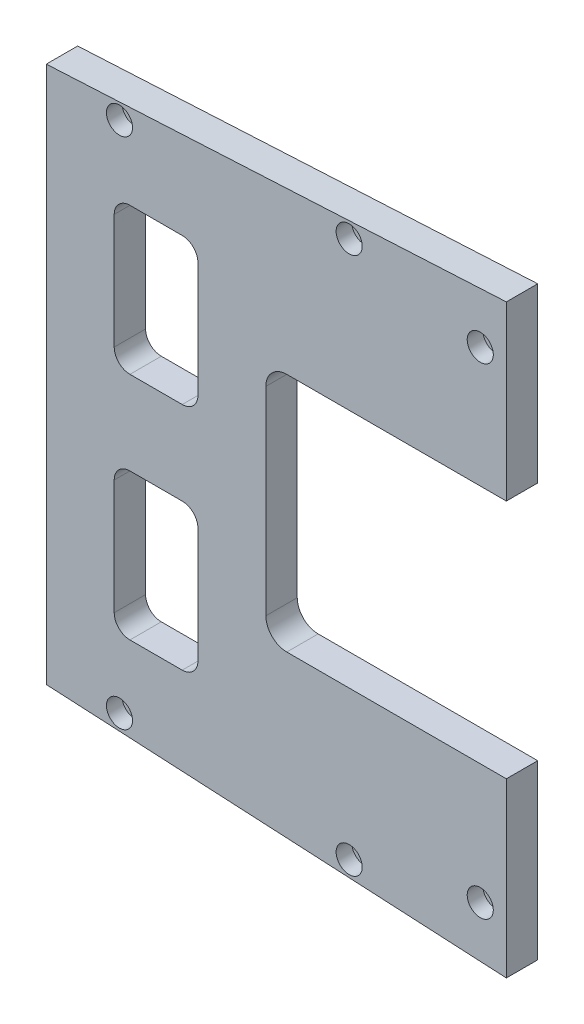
ISO-10303-21;
HEADER;
FILE_DESCRIPTION(('STEP AP214'),'2;1');
FILE_NAME('part.step','',(''),(''),'','','');
FILE_SCHEMA(('AUTOMOTIVE_DESIGN { 1 0 10303 214 1 1 1 1 }'));
ENDSEC;
DATA;
#1=APPLICATION_CONTEXT('core data for automotive mechanical design processes');
#2=APPLICATION_PROTOCOL_DEFINITION('international standard','automotive_design',2000,#1);
#3=PRODUCT_CONTEXT('',#1,'mechanical');
#4=PRODUCT('Part','Part','',(#3));
#5=PRODUCT_RELATED_PRODUCT_CATEGORY('part','',(#4));
#6=PRODUCT_DEFINITION_FORMATION('','',#4);
#7=PRODUCT_DEFINITION_CONTEXT('part definition',#1,'design');
#8=PRODUCT_DEFINITION('design','',#6,#7);
#9=PRODUCT_DEFINITION_SHAPE('','',#8);
#10=(LENGTH_UNIT() NAMED_UNIT(*) SI_UNIT(.MILLI.,.METRE.));
#11=(NAMED_UNIT(*) PLANE_ANGLE_UNIT() SI_UNIT($,.RADIAN.));
#12=(NAMED_UNIT(*) SI_UNIT($,.STERADIAN.) SOLID_ANGLE_UNIT());
#13=UNCERTAINTY_MEASURE_WITH_UNIT(LENGTH_MEASURE(1.E-05),#10,'distance_accuracy_value','');
#14=(GEOMETRIC_REPRESENTATION_CONTEXT(3) GLOBAL_UNCERTAINTY_ASSIGNED_CONTEXT((#13)) GLOBAL_UNIT_ASSIGNED_CONTEXT((#10,
#11,#12)) REPRESENTATION_CONTEXT('',''));
#15=CARTESIAN_POINT('',(0.,0.,0.));
#16=DIRECTION('',(0.,0.,1.));
#17=DIRECTION('',(1.,0.,0.));
#18=AXIS2_PLACEMENT_3D('',#15,#16,#17);
#19=CARTESIAN_POINT('',(0.,0.,9.525));
#20=DIRECTION('',(0.,0.,-1.));
#21=DIRECTION('',(-1.,0.,0.));
#22=AXIS2_PLACEMENT_3D('',#19,#20,#21);
#23=PLANE('',#22);
#24=DIRECTION('',(0.,1.,0.));
#25=VECTOR('',#24,1.);
#26=CARTESIAN_POINT('',(46.0502,0.,9.525));
#27=LINE('',#26,#25);
#28=CARTESIAN_POINT('',(46.0502,-52.3748,9.525));
#29=VERTEX_POINT('',#28);
#30=CARTESIAN_POINT('',(46.0502,-17.4752,9.525));
#31=VERTEX_POINT('',#30);
#32=EDGE_CURVE('E420',#29,#31,#27,.T.);
#33=ORIENTED_EDGE('',*,*,#32,.F.);
#34=CARTESIAN_POINT('',(41.275,-52.3748,9.525));
#35=DIRECTION('',(0.,0.,-1.));
#36=DIRECTION('',(-1.,0.,0.));
#37=AXIS2_PLACEMENT_3D('',#34,#35,#36);
#38=CIRCLE('',#37,4.7752);
#39=CARTESIAN_POINT('',(41.275,-57.15,9.525));
#40=VERTEX_POINT('',#39);
#41=EDGE_CURVE('E345',#29,#40,#38,.T.);
#42=ORIENTED_EDGE('',*,*,#41,.T.);
#43=DIRECTION('',(1.,0.,0.));
#44=VECTOR('',#43,1.);
#45=CARTESIAN_POINT('',(0.,-57.15,9.525));
#46=LINE('',#45,#44);
#47=CARTESIAN_POINT('',(25.4,-57.15,9.525));
#48=VERTEX_POINT('',#47);
#49=EDGE_CURVE('E411',#48,#40,#46,.T.);
#50=ORIENTED_EDGE('',*,*,#49,.F.);
#51=CARTESIAN_POINT('',(25.4,-52.3748,9.525));
#52=DIRECTION('',(0.,0.,-1.));
#53=DIRECTION('',(-1.,0.,0.));
#54=AXIS2_PLACEMENT_3D('',#51,#52,#53);
#55=CIRCLE('',#54,4.7752);
#56=CARTESIAN_POINT('',(20.6248,-52.3748,9.525));
#57=VERTEX_POINT('',#56);
#58=EDGE_CURVE('E341',#48,#57,#55,.T.);
#59=ORIENTED_EDGE('',*,*,#58,.T.);
#60=DIRECTION('',(0.,-1.,0.));
#61=VECTOR('',#60,1.);
#62=CARTESIAN_POINT('',(20.6248,0.,9.525));
#63=LINE('',#62,#61);
#64=CARTESIAN_POINT('',(20.6248,-17.4752,9.525));
#65=VERTEX_POINT('',#64);
#66=EDGE_CURVE('E414',#65,#57,#63,.T.);
#67=ORIENTED_EDGE('',*,*,#66,.F.);
#68=CARTESIAN_POINT('',(25.4,-17.4752,9.525));
#69=DIRECTION('',(0.,0.,-1.));
#70=DIRECTION('',(-1.,0.,0.));
#71=AXIS2_PLACEMENT_3D('',#68,#69,#70);
#72=CIRCLE('',#71,4.7752);
#73=CARTESIAN_POINT('',(25.4,-12.7,9.525));
#74=VERTEX_POINT('',#73);
#75=EDGE_CURVE('E353',#65,#74,#72,.T.);
#76=ORIENTED_EDGE('',*,*,#75,.T.);
#77=DIRECTION('',(-1.,0.,0.));
#78=VECTOR('',#77,1.);
#79=CARTESIAN_POINT('',(0.,-12.7,9.525));
#80=LINE('',#79,#78);
#81=CARTESIAN_POINT('',(41.275,-12.7,9.525));
#82=VERTEX_POINT('',#81);
#83=EDGE_CURVE('E417',#82,#74,#80,.T.);
#84=ORIENTED_EDGE('',*,*,#83,.F.);
#85=CARTESIAN_POINT('',(41.275,-17.4752,9.525));
#86=DIRECTION('',(0.,0.,-1.));
#87=DIRECTION('',(-1.,0.,0.));
#88=AXIS2_PLACEMENT_3D('',#85,#86,#87);
#89=CIRCLE('',#88,4.7752);
#90=EDGE_CURVE('E349',#82,#31,#89,.T.);
#91=ORIENTED_EDGE('',*,*,#90,.T.);
#92=EDGE_LOOP('',(#33,#42,#50,#59,#67,#76,#84,#91));
#93=FACE_BOUND('',#92,.T.);
#94=CARTESIAN_POINT('',(91.979273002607,-81.6173094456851,9.525));
#95=DIRECTION('',(0.,0.,-1.));
#96=DIRECTION('',(-1.,0.,0.));
#97=AXIS2_PLACEMENT_3D('',#94,#95,#96);
#98=CIRCLE('',#97,3.9624);
#99=CARTESIAN_POINT('',(88.016873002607,-81.6173094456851,9.525));
#100=VERTEX_POINT('',#99);
#101=EDGE_CURVE('E290',#100,#100,#98,.F.);
#102=ORIENTED_EDGE('',*,*,#101,.F.);
#103=EDGE_LOOP('',(#102));
#104=FACE_BOUND('',#103,.T.);
#105=CARTESIAN_POINT('',(22.225,77.9616429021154,9.525));
#106=DIRECTION('',(0.,0.,-1.));
#107=DIRECTION('',(-1.,0.,0.));
#108=AXIS2_PLACEMENT_3D('',#105,#106,#107);
#109=CIRCLE('',#108,3.9624);
#110=CARTESIAN_POINT('',(18.2626,77.9616429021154,9.525));
#111=VERTEX_POINT('',#110);
#112=EDGE_CURVE('E275',#111,#111,#109,.F.);
#113=ORIENTED_EDGE('',*,*,#112,.F.);
#114=EDGE_LOOP('',(#113));
#115=FACE_BOUND('',#114,.T.);
#116=CARTESIAN_POINT('',(131.7752,-73.025,9.525));
#117=DIRECTION('',(0.,0.,-1.));
#118=DIRECTION('',(-1.,0.,0.));
#119=AXIS2_PLACEMENT_3D('',#116,#117,#118);
#120=CIRCLE('',#119,3.9624);
#121=CARTESIAN_POINT('',(127.8128,-73.025,9.525));
#122=VERTEX_POINT('',#121);
#123=EDGE_CURVE('E260',#122,#122,#120,.F.);
#124=ORIENTED_EDGE('',*,*,#123,.F.);
#125=EDGE_LOOP('',(#124));
#126=FACE_BOUND('',#125,.T.);
#127=DIRECTION('',(0.,1.,0.));
#128=VECTOR('',#127,1.);
#129=CARTESIAN_POINT('',(139.7,-36.5125,9.525));
#130=LINE('',#129,#128);
#131=CARTESIAN_POINT('',(139.7,-88.9,9.525));
#132=VERTEX_POINT('',#131);
#133=CARTESIAN_POINT('',(139.7,-36.5125,9.525));
#134=VERTEX_POINT('',#133);
#135=EDGE_CURVE('E218',#132,#134,#130,.T.);
#136=ORIENTED_EDGE('',*,*,#135,.T.);
#137=DIRECTION('',(-1.,0.,0.));
#138=VECTOR('',#137,1.);
#139=CARTESIAN_POINT('',(66.675,-36.5125,9.525));
#140=LINE('',#139,#138);
#141=CARTESIAN_POINT('',(73.025,-36.5125,9.525));
#142=VERTEX_POINT('',#141);
#143=EDGE_CURVE('E206',#134,#142,#140,.T.);
#144=ORIENTED_EDGE('',*,*,#143,.T.);
#145=CARTESIAN_POINT('',(73.025,-30.1625,9.525));
#146=DIRECTION('',(0.,0.,-1.));
#147=DIRECTION('',(-1.,0.,0.));
#148=AXIS2_PLACEMENT_3D('',#145,#146,#147);
#149=CIRCLE('',#148,6.35);
#150=CARTESIAN_POINT('',(66.675,-30.1625,9.525));
#151=VERTEX_POINT('',#150);
#152=EDGE_CURVE('E250',#142,#151,#149,.T.);
#153=ORIENTED_EDGE('',*,*,#152,.T.);
#154=DIRECTION('',(0.,1.,0.));
#155=VECTOR('',#154,1.);
#156=CARTESIAN_POINT('',(66.675,36.5125,9.525));
#157=LINE('',#156,#155);
#158=CARTESIAN_POINT('',(66.675,30.1625,9.525));
#159=VERTEX_POINT('',#158);
#160=EDGE_CURVE('E217',#151,#159,#157,.T.);
#161=ORIENTED_EDGE('',*,*,#160,.T.);
#162=CARTESIAN_POINT('',(73.025,30.1625,9.525));
#163=DIRECTION('',(0.,0.,-1.));
#164=DIRECTION('',(-1.,0.,0.));
#165=AXIS2_PLACEMENT_3D('',#162,#163,#164);
#166=CIRCLE('',#165,6.35);
#167=CARTESIAN_POINT('',(73.025,36.5125,9.525));
#168=VERTEX_POINT('',#167);
#169=EDGE_CURVE('E254',#159,#168,#166,.T.);
#170=ORIENTED_EDGE('',*,*,#169,.T.);
#171=DIRECTION('',(1.,0.,0.));
#172=VECTOR('',#171,1.);
#173=CARTESIAN_POINT('',(139.7,36.5125,9.525));
#174=LINE('',#173,#172);
#175=CARTESIAN_POINT('',(139.7,36.5125,9.525));
#176=VERTEX_POINT('',#175);
#177=EDGE_CURVE('E453',#168,#176,#174,.T.);
#178=ORIENTED_EDGE('',*,*,#177,.T.);
#179=DIRECTION('',(0.,1.,0.));
#180=VECTOR('',#179,1.);
#181=CARTESIAN_POINT('',(139.7,88.9,9.525));
#182=LINE('',#181,#180);
#183=CARTESIAN_POINT('',(139.7,88.9,9.525));
#184=VERTEX_POINT('',#183);
#185=EDGE_CURVE('E455',#176,#184,#182,.T.);
#186=ORIENTED_EDGE('',*,*,#185,.T.);
#187=DIRECTION('',(-0.998629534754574,-0.0523359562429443,0.));
#188=VECTOR('',#187,1.);
#189=CARTESIAN_POINT('',(0.,81.5786332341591,9.525));
#190=LINE('',#189,#188);
#191=CARTESIAN_POINT('',(0.,81.5786332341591,9.525));
#192=VERTEX_POINT('',#191);
#193=EDGE_CURVE('E457',#184,#192,#190,.T.);
#194=ORIENTED_EDGE('',*,*,#193,.T.);
#195=DIRECTION('',(0.,-1.,0.));
#196=VECTOR('',#195,1.);
#197=CARTESIAN_POINT('',(0.,0.,9.525));
#198=LINE('',#197,#196);
#199=CARTESIAN_POINT('',(0.,-81.5786332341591,9.525));
#200=VERTEX_POINT('',#199);
#201=EDGE_CURVE('E459',#192,#200,#198,.T.);
#202=ORIENTED_EDGE('',*,*,#201,.T.);
#203=DIRECTION('',(0.998629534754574,-0.0523359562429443,0.));
#204=VECTOR('',#203,1.);
#205=CARTESIAN_POINT('',(139.7,-88.9,9.525));
#206=LINE('',#205,#204);
#207=EDGE_CURVE('E223',#200,#132,#206,.T.);
#208=ORIENTED_EDGE('',*,*,#207,.T.);
#209=EDGE_LOOP('',(#136,#144,#153,#161,#170,#178,#186,#194,#202,#208));
#210=FACE_BOUND('',#209,.T.);
#211=CARTESIAN_POINT('',(131.7752,73.025,9.525));
#212=DIRECTION('',(0.,0.,-1.));
#213=DIRECTION('',(-1.,0.,0.));
#214=AXIS2_PLACEMENT_3D('',#211,#212,#213);
#215=CIRCLE('',#214,3.9624);
#216=CARTESIAN_POINT('',(127.8128,73.025,9.525));
#217=VERTEX_POINT('',#216);
#218=EDGE_CURVE('E268',#217,#217,#215,.F.);
#219=ORIENTED_EDGE('',*,*,#218,.F.);
#220=EDGE_LOOP('',(#219));
#221=FACE_BOUND('',#220,.T.);
#222=CARTESIAN_POINT('',(91.979273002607,81.6173094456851,9.525));
#223=DIRECTION('',(0.,0.,-1.));
#224=DIRECTION('',(-1.,0.,0.));
#225=AXIS2_PLACEMENT_3D('',#222,#223,#224);
#226=CIRCLE('',#225,3.9624);
#227=CARTESIAN_POINT('',(88.016873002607,81.6173094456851,9.525));
#228=VERTEX_POINT('',#227);
#229=EDGE_CURVE('E283',#228,#228,#226,.F.);
#230=ORIENTED_EDGE('',*,*,#229,.F.);
#231=EDGE_LOOP('',(#230));
#232=FACE_BOUND('',#231,.T.);
#233=CARTESIAN_POINT('',(22.225,-77.9616429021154,9.525));
#234=DIRECTION('',(0.,0.,-1.));
#235=DIRECTION('',(-1.,0.,0.));
#236=AXIS2_PLACEMENT_3D('',#233,#234,#235);
#237=CIRCLE('',#236,3.96239999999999);
#238=CARTESIAN_POINT('',(18.2626,-77.9616429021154,9.525));
#239=VERTEX_POINT('',#238);
#240=EDGE_CURVE('E297',#239,#239,#237,.F.);
#241=ORIENTED_EDGE('',*,*,#240,.F.);
#242=EDGE_LOOP('',(#241));
#243=FACE_BOUND('',#242,.T.);
#244=DIRECTION('',(0.,-1.,0.));
#245=VECTOR('',#244,1.);
#246=CARTESIAN_POINT('',(20.6248,0.,9.525));
#247=LINE('',#246,#245);
#248=CARTESIAN_POINT('',(20.6248,52.3748,9.525));
#249=VERTEX_POINT('',#248);
#250=CARTESIAN_POINT('',(20.6248,17.4752,9.525));
#251=VERTEX_POINT('',#250);
#252=EDGE_CURVE('E383',#249,#251,#247,.T.);
#253=ORIENTED_EDGE('',*,*,#252,.F.);
#254=CARTESIAN_POINT('',(25.4,52.3748,9.525));
#255=DIRECTION('',(0.,0.,-1.));
#256=DIRECTION('',(-1.,0.,0.));
#257=AXIS2_PLACEMENT_3D('',#254,#255,#256);
#258=CIRCLE('',#257,4.7752);
#259=CARTESIAN_POINT('',(25.4,57.15,9.525));
#260=VERTEX_POINT('',#259);
#261=EDGE_CURVE('E11',#249,#260,#258,.T.);
#262=ORIENTED_EDGE('',*,*,#261,.T.);
#263=DIRECTION('',(-1.,0.,0.));
#264=VECTOR('',#263,1.);
#265=CARTESIAN_POINT('',(0.,57.15,9.525));
#266=LINE('',#265,#264);
#267=CARTESIAN_POINT('',(41.275,57.15,9.525));
#268=VERTEX_POINT('',#267);
#269=EDGE_CURVE('E381',#268,#260,#266,.T.);
#270=ORIENTED_EDGE('',*,*,#269,.F.);
#271=CARTESIAN_POINT('',(41.275,52.3748,9.525));
#272=DIRECTION('',(0.,0.,-1.));
#273=DIRECTION('',(-1.,0.,0.));
#274=AXIS2_PLACEMENT_3D('',#271,#272,#273);
#275=CIRCLE('',#274,4.7752);
#276=CARTESIAN_POINT('',(46.0502,52.3748,9.525));
#277=VERTEX_POINT('',#276);
#278=EDGE_CURVE('E364',#268,#277,#275,.T.);
#279=ORIENTED_EDGE('',*,*,#278,.T.);
#280=DIRECTION('',(0.,1.,0.));
#281=VECTOR('',#280,1.);
#282=CARTESIAN_POINT('',(46.0502,0.,9.525));
#283=LINE('',#282,#281);
#284=CARTESIAN_POINT('',(46.0502,17.4752,9.525));
#285=VERTEX_POINT('',#284);
#286=EDGE_CURVE('E387',#285,#277,#283,.T.);
#287=ORIENTED_EDGE('',*,*,#286,.F.);
#288=CARTESIAN_POINT('',(41.275,17.4752,9.525));
#289=DIRECTION('',(0.,0.,-1.));
#290=DIRECTION('',(-1.,0.,0.));
#291=AXIS2_PLACEMENT_3D('',#288,#289,#290);
#292=CIRCLE('',#291,4.7752);
#293=CARTESIAN_POINT('',(41.275,12.7,9.525));
#294=VERTEX_POINT('',#293);
#295=EDGE_CURVE('E361',#285,#294,#292,.T.);
#296=ORIENTED_EDGE('',*,*,#295,.T.);
#297=DIRECTION('',(1.,0.,0.));
#298=VECTOR('',#297,1.);
#299=CARTESIAN_POINT('',(0.,12.7,9.525));
#300=LINE('',#299,#298);
#301=CARTESIAN_POINT('',(25.4,12.7,9.525));
#302=VERTEX_POINT('',#301);
#303=EDGE_CURVE('E390',#302,#294,#300,.T.);
#304=ORIENTED_EDGE('',*,*,#303,.F.);
#305=CARTESIAN_POINT('',(25.4,17.4752,9.525));
#306=DIRECTION('',(0.,0.,-1.));
#307=DIRECTION('',(-1.,0.,0.));
#308=AXIS2_PLACEMENT_3D('',#305,#306,#307);
#309=CIRCLE('',#308,4.7752);
#310=EDGE_CURVE('E357',#302,#251,#309,.T.);
#311=ORIENTED_EDGE('',*,*,#310,.T.);
#312=EDGE_LOOP('',(#253,#262,#270,#279,#287,#296,#304,#311));
#313=FACE_BOUND('',#312,.T.);
#314=ADVANCED_FACE('F33',(#93,#104,#115,#126,#210,#221,#232,#243,#313),#23,.F.);
#315=CARTESIAN_POINT('',(0.,0.,0.));
#316=DIRECTION('',(0.,0.,-1.));
#317=DIRECTION('',(-1.,0.,0.));
#318=AXIS2_PLACEMENT_3D('',#315,#316,#317);
#319=PLANE('',#318);
#320=DIRECTION('',(0.,-1.,0.));
#321=VECTOR('',#320,1.);
#322=CARTESIAN_POINT('',(20.6248,-57.15,0.));
#323=LINE('',#322,#321);
#324=CARTESIAN_POINT('',(20.6248,-17.4752,0.));
#325=VERTEX_POINT('',#324);
#326=CARTESIAN_POINT('',(20.6248,-52.3748,0.));
#327=VERTEX_POINT('',#326);
#328=EDGE_CURVE('E405',#325,#327,#323,.T.);
#329=ORIENTED_EDGE('',*,*,#328,.T.);
#330=CARTESIAN_POINT('',(25.4,-52.3748,0.));
#331=DIRECTION('',(0.,0.,-1.));
#332=DIRECTION('',(-1.,0.,0.));
#333=AXIS2_PLACEMENT_3D('',#330,#331,#332);
#334=CIRCLE('',#333,4.7752);
#335=CARTESIAN_POINT('',(25.4,-57.15,0.));
#336=VERTEX_POINT('',#335);
#337=EDGE_CURVE('E339',#327,#336,#334,.F.);
#338=ORIENTED_EDGE('',*,*,#337,.T.);
#339=DIRECTION('',(1.,0.,0.));
#340=VECTOR('',#339,1.);
#341=CARTESIAN_POINT('',(46.0502,-57.15,0.));
#342=LINE('',#341,#340);
#343=CARTESIAN_POINT('',(41.275,-57.15,0.));
#344=VERTEX_POINT('',#343);
#345=EDGE_CURVE('E408',#336,#344,#342,.T.);
#346=ORIENTED_EDGE('',*,*,#345,.T.);
#347=CARTESIAN_POINT('',(41.275,-52.3748,0.));
#348=DIRECTION('',(0.,0.,-1.));
#349=DIRECTION('',(-1.,0.,0.));
#350=AXIS2_PLACEMENT_3D('',#347,#348,#349);
#351=CIRCLE('',#350,4.7752);
#352=CARTESIAN_POINT('',(46.0502,-52.3748,0.));
#353=VERTEX_POINT('',#352);
#354=EDGE_CURVE('E343',#344,#353,#351,.F.);
#355=ORIENTED_EDGE('',*,*,#354,.T.);
#356=DIRECTION('',(0.,1.,0.));
#357=VECTOR('',#356,1.);
#358=CARTESIAN_POINT('',(46.0502,-12.7,0.));
#359=LINE('',#358,#357);
#360=CARTESIAN_POINT('',(46.0502,-17.4752,0.));
#361=VERTEX_POINT('',#360);
#362=EDGE_CURVE('E399',#353,#361,#359,.T.);
#363=ORIENTED_EDGE('',*,*,#362,.T.);
#364=CARTESIAN_POINT('',(41.275,-17.4752,0.));
#365=DIRECTION('',(0.,0.,-1.));
#366=DIRECTION('',(-1.,0.,0.));
#367=AXIS2_PLACEMENT_3D('',#364,#365,#366);
#368=CIRCLE('',#367,4.7752);
#369=CARTESIAN_POINT('',(41.275,-12.7,0.));
#370=VERTEX_POINT('',#369);
#371=EDGE_CURVE('E347',#361,#370,#368,.F.);
#372=ORIENTED_EDGE('',*,*,#371,.T.);
#373=DIRECTION('',(-1.,0.,0.));
#374=VECTOR('',#373,1.);
#375=CARTESIAN_POINT('',(20.6248,-12.7,0.));
#376=LINE('',#375,#374);
#377=CARTESIAN_POINT('',(25.4,-12.7,0.));
#378=VERTEX_POINT('',#377);
#379=EDGE_CURVE('E402',#370,#378,#376,.T.);
#380=ORIENTED_EDGE('',*,*,#379,.T.);
#381=CARTESIAN_POINT('',(25.4,-17.4752,0.));
#382=DIRECTION('',(0.,0.,-1.));
#383=DIRECTION('',(-1.,0.,0.));
#384=AXIS2_PLACEMENT_3D('',#381,#382,#383);
#385=CIRCLE('',#384,4.7752);
#386=EDGE_CURVE('E351',#378,#325,#385,.F.);
#387=ORIENTED_EDGE('',*,*,#386,.T.);
#388=EDGE_LOOP('',(#329,#338,#346,#355,#363,#372,#380,#387));
#389=FACE_BOUND('',#388,.T.);
#390=CARTESIAN_POINT('',(22.225,-77.9616429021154,0.));
#391=DIRECTION('',(0.,0.,1.));
#392=DIRECTION('',(1.,0.,0.));
#393=AXIS2_PLACEMENT_3D('',#390,#391,#392);
#394=CIRCLE('',#393,2.3876);
#395=CARTESIAN_POINT('',(24.6126,-77.9616429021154,0.));
#396=VERTEX_POINT('',#395);
#397=EDGE_CURVE('E433',#396,#396,#394,.T.);
#398=ORIENTED_EDGE('',*,*,#397,.T.);
#399=EDGE_LOOP('',(#398));
#400=FACE_BOUND('',#399,.T.);
#401=CARTESIAN_POINT('',(22.225,77.9616429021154,0.));
#402=DIRECTION('',(0.,0.,1.));
#403=DIRECTION('',(1.,0.,0.));
#404=AXIS2_PLACEMENT_3D('',#401,#402,#403);
#405=CIRCLE('',#404,2.3876);
#406=CARTESIAN_POINT('',(24.6126,77.9616429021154,0.));
#407=VERTEX_POINT('',#406);
#408=EDGE_CURVE('E439',#407,#407,#405,.T.);
#409=ORIENTED_EDGE('',*,*,#408,.T.);
#410=EDGE_LOOP('',(#409));
#411=FACE_BOUND('',#410,.T.);
#412=CARTESIAN_POINT('',(131.7752,73.025,0.));
#413=DIRECTION('',(0.,0.,1.));
#414=DIRECTION('',(1.,0.,0.));
#415=AXIS2_PLACEMENT_3D('',#412,#413,#414);
#416=CIRCLE('',#415,2.38760000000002);
#417=CARTESIAN_POINT('',(134.1628,73.025,0.));
#418=VERTEX_POINT('',#417);
#419=EDGE_CURVE('E448',#418,#418,#416,.T.);
#420=ORIENTED_EDGE('',*,*,#419,.T.);
#421=EDGE_LOOP('',(#420));
#422=FACE_BOUND('',#421,.T.);
#423=DIRECTION('',(0.,1.,0.));
#424=VECTOR('',#423,1.);
#425=CARTESIAN_POINT('',(139.7,-36.5125,0.));
#426=LINE('',#425,#424);
#427=CARTESIAN_POINT('',(139.7,-88.9,0.));
#428=VERTEX_POINT('',#427);
#429=CARTESIAN_POINT('',(139.7,-36.5125,0.));
#430=VERTEX_POINT('',#429);
#431=EDGE_CURVE('E231',#428,#430,#426,.T.);
#432=ORIENTED_EDGE('',*,*,#431,.F.);
#433=DIRECTION('',(0.998629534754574,-0.0523359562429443,0.));
#434=VECTOR('',#433,1.);
#435=CARTESIAN_POINT('',(139.7,-88.9,0.));
#436=LINE('',#435,#434);
#437=CARTESIAN_POINT('',(0.,-81.5786332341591,0.));
#438=VERTEX_POINT('',#437);
#439=EDGE_CURVE('E227',#438,#428,#436,.T.);
#440=ORIENTED_EDGE('',*,*,#439,.F.);
#441=DIRECTION('',(0.,-1.,0.));
#442=VECTOR('',#441,1.);
#443=CARTESIAN_POINT('',(0.,-81.5786332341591,0.));
#444=LINE('',#443,#442);
#445=CARTESIAN_POINT('',(0.,81.5786332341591,0.));
#446=VERTEX_POINT('',#445);
#447=EDGE_CURVE('E476',#446,#438,#444,.T.);
#448=ORIENTED_EDGE('',*,*,#447,.F.);
#449=DIRECTION('',(-0.998629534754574,-0.0523359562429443,0.));
#450=VECTOR('',#449,1.);
#451=CARTESIAN_POINT('',(0.,81.5786332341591,0.));
#452=LINE('',#451,#450);
#453=CARTESIAN_POINT('',(139.7,88.9,0.));
#454=VERTEX_POINT('',#453);
#455=EDGE_CURVE('E473',#454,#446,#452,.T.);
#456=ORIENTED_EDGE('',*,*,#455,.F.);
#457=DIRECTION('',(0.,1.,0.));
#458=VECTOR('',#457,1.);
#459=CARTESIAN_POINT('',(139.7,88.9,0.));
#460=LINE('',#459,#458);
#461=CARTESIAN_POINT('',(139.7,36.5125,0.));
#462=VERTEX_POINT('',#461);
#463=EDGE_CURVE('E471',#462,#454,#460,.T.);
#464=ORIENTED_EDGE('',*,*,#463,.F.);
#465=DIRECTION('',(1.,0.,0.));
#466=VECTOR('',#465,1.);
#467=CARTESIAN_POINT('',(139.7,36.5125,0.));
#468=LINE('',#467,#466);
#469=CARTESIAN_POINT('',(73.025,36.5125,0.));
#470=VERTEX_POINT('',#469);
#471=EDGE_CURVE('E469',#470,#462,#468,.T.);
#472=ORIENTED_EDGE('',*,*,#471,.F.);
#473=CARTESIAN_POINT('',(73.025,30.1625,0.));
#474=DIRECTION('',(0.,0.,-1.));
#475=DIRECTION('',(-1.,0.,0.));
#476=AXIS2_PLACEMENT_3D('',#473,#474,#475);
#477=CIRCLE('',#476,6.35);
#478=CARTESIAN_POINT('',(66.675,30.1625,0.));
#479=VERTEX_POINT('',#478);
#480=EDGE_CURVE('E252',#470,#479,#477,.F.);
#481=ORIENTED_EDGE('',*,*,#480,.T.);
#482=DIRECTION('',(0.,1.,0.));
#483=VECTOR('',#482,1.);
#484=CARTESIAN_POINT('',(66.675,36.5125,0.));
#485=LINE('',#484,#483);
#486=CARTESIAN_POINT('',(66.675,-30.1625,0.));
#487=VERTEX_POINT('',#486);
#488=EDGE_CURVE('E466',#487,#479,#485,.T.);
#489=ORIENTED_EDGE('',*,*,#488,.F.);
#490=CARTESIAN_POINT('',(73.025,-30.1625,0.));
#491=DIRECTION('',(0.,0.,-1.));
#492=DIRECTION('',(-1.,0.,0.));
#493=AXIS2_PLACEMENT_3D('',#490,#491,#492);
#494=CIRCLE('',#493,6.35);
#495=CARTESIAN_POINT('',(73.025,-36.5125,0.));
#496=VERTEX_POINT('',#495);
#497=EDGE_CURVE('E248',#487,#496,#494,.F.);
#498=ORIENTED_EDGE('',*,*,#497,.T.);
#499=DIRECTION('',(-1.,0.,0.));
#500=VECTOR('',#499,1.);
#501=CARTESIAN_POINT('',(66.675,-36.5125,0.));
#502=LINE('',#501,#500);
#503=EDGE_CURVE('E464',#430,#496,#502,.T.);
#504=ORIENTED_EDGE('',*,*,#503,.F.);
#505=EDGE_LOOP('',(#432,#440,#448,#456,#464,#472,#481,#489,#498,#504));
#506=FACE_BOUND('',#505,.T.);
#507=CARTESIAN_POINT('',(131.7752,-73.025,0.));
#508=DIRECTION('',(0.,0.,1.));
#509=DIRECTION('',(1.,0.,0.));
#510=AXIS2_PLACEMENT_3D('',#507,#508,#509);
#511=CIRCLE('',#510,2.38760000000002);
#512=CARTESIAN_POINT('',(134.1628,-73.025,0.));
#513=VERTEX_POINT('',#512);
#514=EDGE_CURVE('E264',#513,#513,#511,.T.);
#515=ORIENTED_EDGE('',*,*,#514,.T.);
#516=EDGE_LOOP('',(#515));
#517=FACE_BOUND('',#516,.T.);
#518=CARTESIAN_POINT('',(91.979273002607,81.6173094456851,0.));
#519=DIRECTION('',(0.,0.,1.));
#520=DIRECTION('',(1.,0.,0.));
#521=AXIS2_PLACEMENT_3D('',#518,#519,#520);
#522=CIRCLE('',#521,2.3876);
#523=CARTESIAN_POINT('',(94.366873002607,81.6173094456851,0.));
#524=VERTEX_POINT('',#523);
#525=EDGE_CURVE('E436',#524,#524,#522,.T.);
#526=ORIENTED_EDGE('',*,*,#525,.T.);
#527=EDGE_LOOP('',(#526));
#528=FACE_BOUND('',#527,.T.);
#529=CARTESIAN_POINT('',(91.979273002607,-81.6173094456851,0.));
#530=DIRECTION('',(0.,0.,1.));
#531=DIRECTION('',(1.,0.,0.));
#532=AXIS2_PLACEMENT_3D('',#529,#530,#531);
#533=CIRCLE('',#532,2.3876);
#534=CARTESIAN_POINT('',(94.366873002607,-81.6173094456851,0.));
#535=VERTEX_POINT('',#534);
#536=EDGE_CURVE('E279',#535,#535,#533,.T.);
#537=ORIENTED_EDGE('',*,*,#536,.T.);
#538=EDGE_LOOP('',(#537));
#539=FACE_BOUND('',#538,.T.);
#540=DIRECTION('',(0.,1.,0.));
#541=VECTOR('',#540,1.);
#542=CARTESIAN_POINT('',(46.0502,12.7,0.));
#543=LINE('',#542,#541);
#544=CARTESIAN_POINT('',(46.0502,17.4752,0.));
#545=VERTEX_POINT('',#544);
#546=CARTESIAN_POINT('',(46.0502,52.3748,0.));
#547=VERTEX_POINT('',#546);
#548=EDGE_CURVE('E392',#545,#547,#543,.T.);
#549=ORIENTED_EDGE('',*,*,#548,.T.);
#550=CARTESIAN_POINT('',(41.275,52.3748,0.));
#551=DIRECTION('',(0.,0.,-1.));
#552=DIRECTION('',(-1.,0.,0.));
#553=AXIS2_PLACEMENT_3D('',#550,#551,#552);
#554=CIRCLE('',#553,4.7752);
#555=CARTESIAN_POINT('',(41.275,57.15,0.));
#556=VERTEX_POINT('',#555);
#557=EDGE_CURVE('E55',#547,#556,#554,.F.);
#558=ORIENTED_EDGE('',*,*,#557,.T.);
#559=DIRECTION('',(-1.,0.,0.));
#560=VECTOR('',#559,1.);
#561=CARTESIAN_POINT('',(46.0502,57.15,0.));
#562=LINE('',#561,#560);
#563=CARTESIAN_POINT('',(25.4,57.15,0.));
#564=VERTEX_POINT('',#563);
#565=EDGE_CURVE('E369',#556,#564,#562,.T.);
#566=ORIENTED_EDGE('',*,*,#565,.T.);
#567=CARTESIAN_POINT('',(25.4,52.3748,0.));
#568=DIRECTION('',(0.,0.,-1.));
#569=DIRECTION('',(-1.,0.,0.));
#570=AXIS2_PLACEMENT_3D('',#567,#568,#569);
#571=CIRCLE('',#570,4.7752);
#572=CARTESIAN_POINT('',(20.6248,52.3748,0.));
#573=VERTEX_POINT('',#572);
#574=EDGE_CURVE('E41',#564,#573,#571,.F.);
#575=ORIENTED_EDGE('',*,*,#574,.T.);
#576=DIRECTION('',(0.,-1.,0.));
#577=VECTOR('',#576,1.);
#578=CARTESIAN_POINT('',(20.6248,57.15,0.));
#579=LINE('',#578,#577);
#580=CARTESIAN_POINT('',(20.6248,17.4752,0.));
#581=VERTEX_POINT('',#580);
#582=EDGE_CURVE('E368',#573,#581,#579,.T.);
#583=ORIENTED_EDGE('',*,*,#582,.T.);
#584=CARTESIAN_POINT('',(25.4,17.4752,0.));
#585=DIRECTION('',(0.,0.,-1.));
#586=DIRECTION('',(-1.,0.,0.));
#587=AXIS2_PLACEMENT_3D('',#584,#585,#586);
#588=CIRCLE('',#587,4.7752);
#589=CARTESIAN_POINT('',(25.4,12.7,0.));
#590=VERTEX_POINT('',#589);
#591=EDGE_CURVE('E355',#581,#590,#588,.F.);
#592=ORIENTED_EDGE('',*,*,#591,.T.);
#593=DIRECTION('',(1.,0.,0.));
#594=VECTOR('',#593,1.);
#595=CARTESIAN_POINT('',(20.6248,12.7,0.));
#596=LINE('',#595,#594);
#597=CARTESIAN_POINT('',(41.275,12.7,0.));
#598=VERTEX_POINT('',#597);
#599=EDGE_CURVE('E375',#590,#598,#596,.T.);
#600=ORIENTED_EDGE('',*,*,#599,.T.);
#601=CARTESIAN_POINT('',(41.275,17.4752,0.));
#602=DIRECTION('',(0.,0.,-1.));
#603=DIRECTION('',(-1.,0.,0.));
#604=AXIS2_PLACEMENT_3D('',#601,#602,#603);
#605=CIRCLE('',#604,4.7752);
#606=EDGE_CURVE('E359',#598,#545,#605,.F.);
#607=ORIENTED_EDGE('',*,*,#606,.T.);
#608=EDGE_LOOP('',(#549,#558,#566,#575,#583,#592,#600,#607));
#609=FACE_BOUND('',#608,.T.);
#610=ADVANCED_FACE('F367',(#389,#400,#411,#422,#506,#517,#528,#539,#609),#319,.T.);
#611=CARTESIAN_POINT('',(22.225,-77.9616429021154,20.32));
#612=DIRECTION('',(0.,0.,-1.));
#613=DIRECTION('',(-1.,0.,0.));
#614=AXIS2_PLACEMENT_3D('',#611,#612,#613);
#615=CYLINDRICAL_SURFACE('',#614,2.3876);
#616=ORIENTED_EDGE('',*,*,#397,.F.);
#617=EDGE_LOOP('',(#616));
#618=FACE_BOUND('',#617,.T.);
#619=CARTESIAN_POINT('',(22.225,-77.9616429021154,4.7752));
#620=DIRECTION('',(0.,0.,1.));
#621=DIRECTION('',(1.,0.,0.));
#622=AXIS2_PLACEMENT_3D('',#619,#620,#621);
#623=CIRCLE('',#622,2.3876);
#624=CARTESIAN_POINT('',(24.6126,-77.9616429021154,4.7752));
#625=VERTEX_POINT('',#624);
#626=EDGE_CURVE('E294',#625,#625,#623,.T.);
#627=ORIENTED_EDGE('',*,*,#626,.T.);
#628=EDGE_LOOP('',(#627));
#629=FACE_BOUND('',#628,.T.);
#630=ADVANCED_FACE('F536',(#618,#629),#615,.F.);
#631=CARTESIAN_POINT('',(91.979273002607,-81.6173094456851,20.32));
#632=DIRECTION('',(0.,0.,-1.));
#633=DIRECTION('',(-1.,0.,0.));
#634=AXIS2_PLACEMENT_3D('',#631,#632,#633);
#635=CYLINDRICAL_SURFACE('',#634,2.3876);
#636=ORIENTED_EDGE('',*,*,#536,.F.);
#637=EDGE_LOOP('',(#636));
#638=FACE_BOUND('',#637,.T.);
#639=CARTESIAN_POINT('',(91.979273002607,-81.6173094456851,4.7752));
#640=DIRECTION('',(0.,0.,1.));
#641=DIRECTION('',(1.,0.,0.));
#642=AXIS2_PLACEMENT_3D('',#639,#640,#641);
#643=CIRCLE('',#642,2.3876);
#644=CARTESIAN_POINT('',(94.366873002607,-81.6173094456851,4.7752));
#645=VERTEX_POINT('',#644);
#646=EDGE_CURVE('E287',#645,#645,#643,.T.);
#647=ORIENTED_EDGE('',*,*,#646,.T.);
#648=EDGE_LOOP('',(#647));
#649=FACE_BOUND('',#648,.T.);
#650=ADVANCED_FACE('F854',(#638,#649),#635,.F.);
#651=CARTESIAN_POINT('',(91.979273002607,81.6173094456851,20.32));
#652=DIRECTION('',(0.,0.,-1.));
#653=DIRECTION('',(-1.,0.,0.));
#654=AXIS2_PLACEMENT_3D('',#651,#652,#653);
#655=CYLINDRICAL_SURFACE('',#654,2.3876);
#656=ORIENTED_EDGE('',*,*,#525,.F.);
#657=EDGE_LOOP('',(#656));
#658=FACE_BOUND('',#657,.T.);
#659=CARTESIAN_POINT('',(91.979273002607,81.6173094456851,4.7752));
#660=DIRECTION('',(0.,0.,1.));
#661=DIRECTION('',(1.,0.,0.));
#662=AXIS2_PLACEMENT_3D('',#659,#660,#661);
#663=CIRCLE('',#662,2.3876);
#664=CARTESIAN_POINT('',(94.366873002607,81.6173094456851,4.7752));
#665=VERTEX_POINT('',#664);
#666=EDGE_CURVE('E280',#665,#665,#663,.T.);
#667=ORIENTED_EDGE('',*,*,#666,.T.);
#668=EDGE_LOOP('',(#667));
#669=FACE_BOUND('',#668,.T.);
#670=ADVANCED_FACE('F863',(#658,#669),#655,.F.);
#671=CARTESIAN_POINT('',(22.225,77.9616429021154,20.32));
#672=DIRECTION('',(0.,0.,-1.));
#673=DIRECTION('',(-1.,0.,0.));
#674=AXIS2_PLACEMENT_3D('',#671,#672,#673);
#675=CYLINDRICAL_SURFACE('',#674,2.3876);
#676=ORIENTED_EDGE('',*,*,#408,.F.);
#677=EDGE_LOOP('',(#676));
#678=FACE_BOUND('',#677,.T.);
#679=CARTESIAN_POINT('',(22.225,77.9616429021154,4.7752));
#680=DIRECTION('',(0.,0.,1.));
#681=DIRECTION('',(1.,0.,0.));
#682=AXIS2_PLACEMENT_3D('',#679,#680,#681);
#683=CIRCLE('',#682,2.3876);
#684=CARTESIAN_POINT('',(24.6126,77.9616429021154,4.7752));
#685=VERTEX_POINT('',#684);
#686=EDGE_CURVE('E272',#685,#685,#683,.T.);
#687=ORIENTED_EDGE('',*,*,#686,.T.);
#688=EDGE_LOOP('',(#687));
#689=FACE_BOUND('',#688,.T.);
#690=ADVANCED_FACE('F872',(#678,#689),#675,.F.);
#691=CARTESIAN_POINT('',(131.7752,73.025,12.7));
#692=DIRECTION('',(0.,0.,-1.));
#693=DIRECTION('',(-1.,0.,0.));
#694=AXIS2_PLACEMENT_3D('',#691,#692,#693);
#695=CYLINDRICAL_SURFACE('',#694,2.38760000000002);
#696=ORIENTED_EDGE('',*,*,#419,.F.);
#697=EDGE_LOOP('',(#696));
#698=FACE_BOUND('',#697,.T.);
#699=CARTESIAN_POINT('',(131.7752,73.025,4.7752));
#700=DIRECTION('',(0.,0.,1.));
#701=DIRECTION('',(1.,0.,0.));
#702=AXIS2_PLACEMENT_3D('',#699,#700,#701);
#703=CIRCLE('',#702,2.38760000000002);
#704=CARTESIAN_POINT('',(134.1628,73.025,4.7752));
#705=VERTEX_POINT('',#704);
#706=EDGE_CURVE('E265',#705,#705,#703,.T.);
#707=ORIENTED_EDGE('',*,*,#706,.T.);
#708=EDGE_LOOP('',(#707));
#709=FACE_BOUND('',#708,.T.);
#710=ADVANCED_FACE('F542',(#698,#709),#695,.F.);
#711=CARTESIAN_POINT('',(131.7752,-73.025,12.7));
#712=DIRECTION('',(0.,0.,-1.));
#713=DIRECTION('',(-1.,0.,0.));
#714=AXIS2_PLACEMENT_3D('',#711,#712,#713);
#715=CYLINDRICAL_SURFACE('',#714,2.38760000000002);
#716=ORIENTED_EDGE('',*,*,#514,.F.);
#717=EDGE_LOOP('',(#716));
#718=FACE_BOUND('',#717,.T.);
#719=CARTESIAN_POINT('',(131.7752,-73.025,4.7752));
#720=DIRECTION('',(0.,0.,1.));
#721=DIRECTION('',(1.,0.,0.));
#722=AXIS2_PLACEMENT_3D('',#719,#720,#721);
#723=CIRCLE('',#722,2.38760000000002);
#724=CARTESIAN_POINT('',(134.1628,-73.025,4.7752));
#725=VERTEX_POINT('',#724);
#726=EDGE_CURVE('E257',#725,#725,#723,.T.);
#727=ORIENTED_EDGE('',*,*,#726,.T.);
#728=EDGE_LOOP('',(#727));
#729=FACE_BOUND('',#728,.T.);
#730=ADVANCED_FACE('F895',(#718,#729),#715,.F.);
#731=CARTESIAN_POINT('',(139.7,-36.5125,9.525));
#732=DIRECTION('',(-1.,0.,0.));
#733=DIRECTION('',(0.,0.,1.));
#734=AXIS2_PLACEMENT_3D('',#731,#732,#733);
#735=PLANE('',#734);
#736=ORIENTED_EDGE('',*,*,#431,.T.);
#737=DIRECTION('',(0.,0.,-1.));
#738=VECTOR('',#737,1.);
#739=CARTESIAN_POINT('',(139.7,-36.5125,9.525));
#740=LINE('',#739,#738);
#741=EDGE_CURVE('E211',#134,#430,#740,.T.);
#742=ORIENTED_EDGE('',*,*,#741,.F.);
#743=ORIENTED_EDGE('',*,*,#135,.F.);
#744=DIRECTION('',(0.,0.,-1.));
#745=VECTOR('',#744,1.);
#746=CARTESIAN_POINT('',(139.7,-88.9,9.525));
#747=LINE('',#746,#745);
#748=EDGE_CURVE('E462',#132,#428,#747,.T.);
#749=ORIENTED_EDGE('',*,*,#748,.T.);
#750=EDGE_LOOP('',(#736,#742,#743,#749));
#751=FACE_BOUND('',#750,.T.);
#752=ADVANCED_FACE('F229',(#751),#735,.F.);
#753=CARTESIAN_POINT('',(66.675,-36.5125,9.525));
#754=DIRECTION('',(0.,-1.,0.));
#755=DIRECTION('',(1.,0.,0.));
#756=AXIS2_PLACEMENT_3D('',#753,#754,#755);
#757=PLANE('',#756);
#758=ORIENTED_EDGE('',*,*,#503,.T.);
#759=DIRECTION('',(0.,0.,-1.));
#760=VECTOR('',#759,1.);
#761=CARTESIAN_POINT('',(73.025,-36.5125,9.525));
#762=LINE('',#761,#760);
#763=EDGE_CURVE('E214',#496,#142,#762,.F.);
#764=ORIENTED_EDGE('',*,*,#763,.T.);
#765=ORIENTED_EDGE('',*,*,#143,.F.);
#766=ORIENTED_EDGE('',*,*,#741,.T.);
#767=EDGE_LOOP('',(#758,#764,#765,#766));
#768=FACE_BOUND('',#767,.T.);
#769=ADVANCED_FACE('F209',(#768),#757,.F.);
#770=CARTESIAN_POINT('',(66.675,36.5125,9.525));
#771=DIRECTION('',(-1.,0.,0.));
#772=DIRECTION('',(0.,0.,1.));
#773=AXIS2_PLACEMENT_3D('',#770,#771,#772);
#774=PLANE('',#773);
#775=ORIENTED_EDGE('',*,*,#160,.F.);
#776=DIRECTION('',(0.,0.,-1.));
#777=VECTOR('',#776,1.);
#778=CARTESIAN_POINT('',(66.675,-30.1625,0.));
#779=LINE('',#778,#777);
#780=EDGE_CURVE('E235',#151,#487,#779,.T.);
#781=ORIENTED_EDGE('',*,*,#780,.T.);
#782=ORIENTED_EDGE('',*,*,#488,.T.);
#783=DIRECTION('',(0.,0.,-1.));
#784=VECTOR('',#783,1.);
#785=CARTESIAN_POINT('',(66.675,30.1625,9.525));
#786=LINE('',#785,#784);
#787=EDGE_CURVE('E232',#479,#159,#786,.F.);
#788=ORIENTED_EDGE('',*,*,#787,.T.);
#789=EDGE_LOOP('',(#775,#781,#782,#788));
#790=FACE_BOUND('',#789,.T.);
#791=ADVANCED_FACE('F512',(#790),#774,.F.);
#792=CARTESIAN_POINT('',(139.7,36.5125,9.525));
#793=DIRECTION('',(0.,1.,0.));
#794=DIRECTION('',(-1.,0.,0.));
#795=AXIS2_PLACEMENT_3D('',#792,#793,#794);
#796=PLANE('',#795);
#797=ORIENTED_EDGE('',*,*,#177,.F.);
#798=DIRECTION('',(0.,0.,-1.));
#799=VECTOR('',#798,1.);
#800=CARTESIAN_POINT('',(73.025,36.5125,0.));
#801=LINE('',#800,#799);
#802=EDGE_CURVE('E245',#168,#470,#801,.T.);
#803=ORIENTED_EDGE('',*,*,#802,.T.);
#804=ORIENTED_EDGE('',*,*,#471,.T.);
#805=DIRECTION('',(0.,0.,-1.));
#806=VECTOR('',#805,1.);
#807=CARTESIAN_POINT('',(139.7,36.5125,9.525));
#808=LINE('',#807,#806);
#809=EDGE_CURVE('E233',#176,#462,#808,.T.);
#810=ORIENTED_EDGE('',*,*,#809,.F.);
#811=EDGE_LOOP('',(#797,#803,#804,#810));
#812=FACE_BOUND('',#811,.T.);
#813=ADVANCED_FACE('F520',(#812),#796,.F.);
#814=CARTESIAN_POINT('',(139.7,88.9,9.525));
#815=DIRECTION('',(-1.,0.,0.));
#816=DIRECTION('',(0.,0.,1.));
#817=AXIS2_PLACEMENT_3D('',#814,#815,#816);
#818=PLANE('',#817);
#819=ORIENTED_EDGE('',*,*,#463,.T.);
#820=DIRECTION('',(0.,0.,-1.));
#821=VECTOR('',#820,1.);
#822=CARTESIAN_POINT('',(139.7,88.9,9.525));
#823=LINE('',#822,#821);
#824=EDGE_CURVE('E238',#184,#454,#823,.T.);
#825=ORIENTED_EDGE('',*,*,#824,.F.);
#826=ORIENTED_EDGE('',*,*,#185,.F.);
#827=ORIENTED_EDGE('',*,*,#809,.T.);
#828=EDGE_LOOP('',(#819,#825,#826,#827));
#829=FACE_BOUND('',#828,.T.);
#830=ADVANCED_FACE('F521',(#829),#818,.F.);
#831=CARTESIAN_POINT('',(0.,81.5786332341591,9.525));
#832=DIRECTION('',(0.0523359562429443,-0.998629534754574,0.));
#833=DIRECTION('',(0.998629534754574,0.0523359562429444,0.));
#834=AXIS2_PLACEMENT_3D('',#831,#832,#833);
#835=PLANE('',#834);
#836=ORIENTED_EDGE('',*,*,#455,.T.);
#837=DIRECTION('',(0.,0.,-1.));
#838=VECTOR('',#837,1.);
#839=CARTESIAN_POINT('',(0.,81.5786332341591,9.525));
#840=LINE('',#839,#838);
#841=EDGE_CURVE('E483',#192,#446,#840,.T.);
#842=ORIENTED_EDGE('',*,*,#841,.F.);
#843=ORIENTED_EDGE('',*,*,#193,.F.);
#844=ORIENTED_EDGE('',*,*,#824,.T.);
#845=EDGE_LOOP('',(#836,#842,#843,#844));
#846=FACE_BOUND('',#845,.T.);
#847=ADVANCED_FACE('F490',(#846),#835,.F.);
#848=CARTESIAN_POINT('',(0.,-81.5786332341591,9.525));
#849=DIRECTION('',(1.,0.,0.));
#850=DIRECTION('',(0.,0.,-1.));
#851=AXIS2_PLACEMENT_3D('',#848,#849,#850);
#852=PLANE('',#851);
#853=ORIENTED_EDGE('',*,*,#447,.T.);
#854=DIRECTION('',(0.,0.,-1.));
#855=VECTOR('',#854,1.);
#856=CARTESIAN_POINT('',(0.,-81.5786332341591,9.525));
#857=LINE('',#856,#855);
#858=EDGE_CURVE('E480',#200,#438,#857,.T.);
#859=ORIENTED_EDGE('',*,*,#858,.F.);
#860=ORIENTED_EDGE('',*,*,#201,.F.);
#861=ORIENTED_EDGE('',*,*,#841,.T.);
#862=EDGE_LOOP('',(#853,#859,#860,#861));
#863=FACE_BOUND('',#862,.T.);
#864=ADVANCED_FACE('F501',(#863),#852,.F.);
#865=CARTESIAN_POINT('',(139.7,-88.9,9.525));
#866=DIRECTION('',(0.0523359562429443,0.998629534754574,0.));
#867=DIRECTION('',(-0.998629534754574,0.0523359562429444,0.));
#868=AXIS2_PLACEMENT_3D('',#865,#866,#867);
#869=PLANE('',#868);
#870=ORIENTED_EDGE('',*,*,#439,.T.);
#871=ORIENTED_EDGE('',*,*,#748,.F.);
#872=ORIENTED_EDGE('',*,*,#207,.F.);
#873=ORIENTED_EDGE('',*,*,#858,.T.);
#874=EDGE_LOOP('',(#870,#871,#872,#873));
#875=FACE_BOUND('',#874,.T.);
#876=ADVANCED_FACE('F504',(#875),#869,.F.);
#877=CARTESIAN_POINT('',(73.025,-30.1625,9.525));
#878=DIRECTION('',(0.,0.,1.));
#879=DIRECTION('',(1.,0.,0.));
#880=AXIS2_PLACEMENT_3D('',#877,#878,#879);
#881=CYLINDRICAL_SURFACE('',#880,6.35);
#882=ORIENTED_EDGE('',*,*,#152,.F.);
#883=ORIENTED_EDGE('',*,*,#763,.F.);
#884=ORIENTED_EDGE('',*,*,#497,.F.);
#885=ORIENTED_EDGE('',*,*,#780,.F.);
#886=EDGE_LOOP('',(#882,#883,#884,#885));
#887=FACE_BOUND('',#886,.T.);
#888=ADVANCED_FACE('F507',(#887),#881,.F.);
#889=CARTESIAN_POINT('',(73.025,30.1625,9.525));
#890=DIRECTION('',(0.,0.,1.));
#891=DIRECTION('',(1.,0.,0.));
#892=AXIS2_PLACEMENT_3D('',#889,#890,#891);
#893=CYLINDRICAL_SURFACE('',#892,6.35);
#894=ORIENTED_EDGE('',*,*,#169,.F.);
#895=ORIENTED_EDGE('',*,*,#787,.F.);
#896=ORIENTED_EDGE('',*,*,#480,.F.);
#897=ORIENTED_EDGE('',*,*,#802,.F.);
#898=EDGE_LOOP('',(#894,#895,#896,#897));
#899=FACE_BOUND('',#898,.T.);
#900=ADVANCED_FACE('F515',(#899),#893,.F.);
#901=CARTESIAN_POINT('',(131.7752,-73.025,17.4752));
#902=DIRECTION('',(0.,0.,-1.));
#903=DIRECTION('',(-1.,0.,0.));
#904=AXIS2_PLACEMENT_3D('',#901,#902,#903);
#905=CYLINDRICAL_SURFACE('',#904,3.9624);
#906=CARTESIAN_POINT('',(131.7752,-73.025,4.7752));
#907=DIRECTION('',(0.,0.,1.));
#908=DIRECTION('',(1.,0.,0.));
#909=AXIS2_PLACEMENT_3D('',#906,#907,#908);
#910=CIRCLE('',#909,3.9624);
#911=CARTESIAN_POINT('',(135.7376,-73.025,4.7752));
#912=VERTEX_POINT('',#911);
#913=EDGE_CURVE('E261',#912,#912,#910,.T.);
#914=ORIENTED_EDGE('',*,*,#913,.F.);
#915=EDGE_LOOP('',(#914));
#916=FACE_BOUND('',#915,.T.);
#917=ORIENTED_EDGE('',*,*,#123,.T.);
#918=EDGE_LOOP('',(#917));
#919=FACE_BOUND('',#918,.T.);
#920=ADVANCED_FACE('F570',(#916,#919),#905,.F.);
#921=CARTESIAN_POINT('',(131.7752,-73.025,4.7752));
#922=DIRECTION('',(0.,0.,1.));
#923=DIRECTION('',(1.,0.,0.));
#924=AXIS2_PLACEMENT_3D('',#921,#922,#923);
#925=PLANE('',#924);
#926=ORIENTED_EDGE('',*,*,#726,.F.);
#927=EDGE_LOOP('',(#926));
#928=FACE_BOUND('',#927,.T.);
#929=ORIENTED_EDGE('',*,*,#913,.T.);
#930=EDGE_LOOP('',(#929));
#931=FACE_BOUND('',#930,.T.);
#932=ADVANCED_FACE('F578',(#928,#931),#925,.T.);
#933=CARTESIAN_POINT('',(131.7752,73.025,17.4752));
#934=DIRECTION('',(0.,0.,-1.));
#935=DIRECTION('',(-1.,0.,0.));
#936=AXIS2_PLACEMENT_3D('',#933,#934,#935);
#937=CYLINDRICAL_SURFACE('',#936,3.9624);
#938=CARTESIAN_POINT('',(131.7752,73.025,4.7752));
#939=DIRECTION('',(0.,0.,1.));
#940=DIRECTION('',(1.,0.,0.));
#941=AXIS2_PLACEMENT_3D('',#938,#939,#940);
#942=CIRCLE('',#941,3.9624);
#943=CARTESIAN_POINT('',(135.7376,73.025,4.7752));
#944=VERTEX_POINT('',#943);
#945=EDGE_CURVE('E269',#944,#944,#942,.T.);
#946=ORIENTED_EDGE('',*,*,#945,.F.);
#947=EDGE_LOOP('',(#946));
#948=FACE_BOUND('',#947,.T.);
#949=ORIENTED_EDGE('',*,*,#218,.T.);
#950=EDGE_LOOP('',(#949));
#951=FACE_BOUND('',#950,.T.);
#952=ADVANCED_FACE('F587',(#948,#951),#937,.F.);
#953=CARTESIAN_POINT('',(131.7752,73.025,4.7752));
#954=DIRECTION('',(0.,0.,1.));
#955=DIRECTION('',(1.,0.,0.));
#956=AXIS2_PLACEMENT_3D('',#953,#954,#955);
#957=PLANE('',#956);
#958=ORIENTED_EDGE('',*,*,#706,.F.);
#959=EDGE_LOOP('',(#958));
#960=FACE_BOUND('',#959,.T.);
#961=ORIENTED_EDGE('',*,*,#945,.T.);
#962=EDGE_LOOP('',(#961));
#963=FACE_BOUND('',#962,.T.);
#964=ADVANCED_FACE('F595',(#960,#963),#957,.T.);
#965=CARTESIAN_POINT('',(22.225,77.9616429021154,25.0952));
#966=DIRECTION('',(0.,0.,-1.));
#967=DIRECTION('',(-1.,0.,0.));
#968=AXIS2_PLACEMENT_3D('',#965,#966,#967);
#969=CYLINDRICAL_SURFACE('',#968,3.9624);
#970=CARTESIAN_POINT('',(22.225,77.9616429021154,4.7752));
#971=DIRECTION('',(0.,0.,1.));
#972=DIRECTION('',(1.,0.,0.));
#973=AXIS2_PLACEMENT_3D('',#970,#971,#972);
#974=CIRCLE('',#973,3.9624);
#975=CARTESIAN_POINT('',(26.1874,77.9616429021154,4.7752));
#976=VERTEX_POINT('',#975);
#977=EDGE_CURVE('E276',#976,#976,#974,.T.);
#978=ORIENTED_EDGE('',*,*,#977,.F.);
#979=EDGE_LOOP('',(#978));
#980=FACE_BOUND('',#979,.T.);
#981=ORIENTED_EDGE('',*,*,#112,.T.);
#982=EDGE_LOOP('',(#981));
#983=FACE_BOUND('',#982,.T.);
#984=ADVANCED_FACE('F603',(#980,#983),#969,.F.);
#985=CARTESIAN_POINT('',(22.225,77.9616429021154,4.7752));
#986=DIRECTION('',(0.,0.,1.));
#987=DIRECTION('',(1.,0.,0.));
#988=AXIS2_PLACEMENT_3D('',#985,#986,#987);
#989=PLANE('',#988);
#990=ORIENTED_EDGE('',*,*,#686,.F.);
#991=EDGE_LOOP('',(#990));
#992=FACE_BOUND('',#991,.T.);
#993=ORIENTED_EDGE('',*,*,#977,.T.);
#994=EDGE_LOOP('',(#993));
#995=FACE_BOUND('',#994,.T.);
#996=ADVANCED_FACE('F612',(#992,#995),#989,.T.);
#997=CARTESIAN_POINT('',(91.979273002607,81.6173094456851,25.0952));
#998=DIRECTION('',(0.,0.,-1.));
#999=DIRECTION('',(-1.,0.,0.));
#1000=AXIS2_PLACEMENT_3D('',#997,#998,#999);
#1001=CYLINDRICAL_SURFACE('',#1000,3.9624);
#1002=CARTESIAN_POINT('',(91.979273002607,81.6173094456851,4.7752));
#1003=DIRECTION('',(0.,0.,1.));
#1004=DIRECTION('',(1.,0.,0.));
#1005=AXIS2_PLACEMENT_3D('',#1002,#1003,#1004);
#1006=CIRCLE('',#1005,3.9624);
#1007=CARTESIAN_POINT('',(95.941673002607,81.6173094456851,4.7752));
#1008=VERTEX_POINT('',#1007);
#1009=EDGE_CURVE('E284',#1008,#1008,#1006,.T.);
#1010=ORIENTED_EDGE('',*,*,#1009,.F.);
#1011=EDGE_LOOP('',(#1010));
#1012=FACE_BOUND('',#1011,.T.);
#1013=ORIENTED_EDGE('',*,*,#229,.T.);
#1014=EDGE_LOOP('',(#1013));
#1015=FACE_BOUND('',#1014,.T.);
#1016=ADVANCED_FACE('F621',(#1012,#1015),#1001,.F.);
#1017=CARTESIAN_POINT('',(91.979273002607,81.6173094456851,4.7752));
#1018=DIRECTION('',(0.,0.,1.));
#1019=DIRECTION('',(1.,0.,0.));
#1020=AXIS2_PLACEMENT_3D('',#1017,#1018,#1019);
#1021=PLANE('',#1020);
#1022=ORIENTED_EDGE('',*,*,#666,.F.);
#1023=EDGE_LOOP('',(#1022));
#1024=FACE_BOUND('',#1023,.T.);
#1025=ORIENTED_EDGE('',*,*,#1009,.T.);
#1026=EDGE_LOOP('',(#1025));
#1027=FACE_BOUND('',#1026,.T.);
#1028=ADVANCED_FACE('F629',(#1024,#1027),#1021,.T.);
#1029=CARTESIAN_POINT('',(91.979273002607,-81.6173094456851,25.0952));
#1030=DIRECTION('',(0.,0.,-1.));
#1031=DIRECTION('',(-1.,0.,0.));
#1032=AXIS2_PLACEMENT_3D('',#1029,#1030,#1031);
#1033=CYLINDRICAL_SURFACE('',#1032,3.9624);
#1034=CARTESIAN_POINT('',(91.979273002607,-81.6173094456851,4.7752));
#1035=DIRECTION('',(0.,0.,1.));
#1036=DIRECTION('',(1.,0.,0.));
#1037=AXIS2_PLACEMENT_3D('',#1034,#1035,#1036);
#1038=CIRCLE('',#1037,3.9624);
#1039=CARTESIAN_POINT('',(95.941673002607,-81.6173094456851,4.7752));
#1040=VERTEX_POINT('',#1039);
#1041=EDGE_CURVE('E291',#1040,#1040,#1038,.T.);
#1042=ORIENTED_EDGE('',*,*,#1041,.F.);
#1043=EDGE_LOOP('',(#1042));
#1044=FACE_BOUND('',#1043,.T.);
#1045=ORIENTED_EDGE('',*,*,#101,.T.);
#1046=EDGE_LOOP('',(#1045));
#1047=FACE_BOUND('',#1046,.T.);
#1048=ADVANCED_FACE('F637',(#1044,#1047),#1033,.F.);
#1049=CARTESIAN_POINT('',(91.979273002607,-81.6173094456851,4.7752));
#1050=DIRECTION('',(0.,0.,1.));
#1051=DIRECTION('',(1.,0.,0.));
#1052=AXIS2_PLACEMENT_3D('',#1049,#1050,#1051);
#1053=PLANE('',#1052);
#1054=ORIENTED_EDGE('',*,*,#646,.F.);
#1055=EDGE_LOOP('',(#1054));
#1056=FACE_BOUND('',#1055,.T.);
#1057=ORIENTED_EDGE('',*,*,#1041,.T.);
#1058=EDGE_LOOP('',(#1057));
#1059=FACE_BOUND('',#1058,.T.);
#1060=ADVANCED_FACE('F645',(#1056,#1059),#1053,.T.);
#1061=CARTESIAN_POINT('',(22.225,-77.9616429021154,25.0952));
#1062=DIRECTION('',(0.,0.,-1.));
#1063=DIRECTION('',(-1.,0.,0.));
#1064=AXIS2_PLACEMENT_3D('',#1061,#1062,#1063);
#1065=CYLINDRICAL_SURFACE('',#1064,3.96239999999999);
#1066=CARTESIAN_POINT('',(22.225,-77.9616429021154,4.7752));
#1067=DIRECTION('',(0.,0.,1.));
#1068=DIRECTION('',(1.,0.,0.));
#1069=AXIS2_PLACEMENT_3D('',#1066,#1067,#1068);
#1070=CIRCLE('',#1069,3.96239999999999);
#1071=CARTESIAN_POINT('',(26.1874,-77.9616429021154,4.7752));
#1072=VERTEX_POINT('',#1071);
#1073=EDGE_CURVE('E298',#1072,#1072,#1070,.T.);
#1074=ORIENTED_EDGE('',*,*,#1073,.F.);
#1075=EDGE_LOOP('',(#1074));
#1076=FACE_BOUND('',#1075,.T.);
#1077=ORIENTED_EDGE('',*,*,#240,.T.);
#1078=EDGE_LOOP('',(#1077));
#1079=FACE_BOUND('',#1078,.T.);
#1080=ADVANCED_FACE('F653',(#1076,#1079),#1065,.F.);
#1081=CARTESIAN_POINT('',(22.225,-77.9616429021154,4.7752));
#1082=DIRECTION('',(0.,0.,1.));
#1083=DIRECTION('',(1.,0.,0.));
#1084=AXIS2_PLACEMENT_3D('',#1081,#1082,#1083);
#1085=PLANE('',#1084);
#1086=ORIENTED_EDGE('',*,*,#626,.F.);
#1087=EDGE_LOOP('',(#1086));
#1088=FACE_BOUND('',#1087,.T.);
#1089=ORIENTED_EDGE('',*,*,#1073,.T.);
#1090=EDGE_LOOP('',(#1089));
#1091=FACE_BOUND('',#1090,.T.);
#1092=ADVANCED_FACE('F661',(#1088,#1091),#1085,.T.);
#1093=CARTESIAN_POINT('',(46.0502,-12.7,20.32));
#1094=DIRECTION('',(-1.,0.,0.));
#1095=DIRECTION('',(0.,-1.,0.));
#1096=AXIS2_PLACEMENT_3D('',#1093,#1094,#1095);
#1097=PLANE('',#1096);
#1098=ORIENTED_EDGE('',*,*,#362,.F.);
#1099=DIRECTION('',(0.,0.,-1.));
#1100=VECTOR('',#1099,1.);
#1101=CARTESIAN_POINT('',(46.0502,-52.3748,9.525));
#1102=LINE('',#1101,#1100);
#1103=EDGE_CURVE('E313',#353,#29,#1102,.F.);
#1104=ORIENTED_EDGE('',*,*,#1103,.T.);
#1105=ORIENTED_EDGE('',*,*,#32,.T.);
#1106=DIRECTION('',(0.,0.,-1.));
#1107=VECTOR('',#1106,1.);
#1108=CARTESIAN_POINT('',(46.0502,-17.4752,0.));
#1109=LINE('',#1108,#1107);
#1110=EDGE_CURVE('E310',#31,#361,#1109,.T.);
#1111=ORIENTED_EDGE('',*,*,#1110,.T.);
#1112=EDGE_LOOP('',(#1098,#1104,#1105,#1111));
#1113=FACE_BOUND('',#1112,.T.);
#1114=ADVANCED_FACE('F669',(#1113),#1097,.T.);
#1115=CARTESIAN_POINT('',(20.6248,-12.7,20.32));
#1116=DIRECTION('',(0.,-1.,0.));
#1117=DIRECTION('',(1.,0.,0.));
#1118=AXIS2_PLACEMENT_3D('',#1115,#1116,#1117);
#1119=PLANE('',#1118);
#1120=ORIENTED_EDGE('',*,*,#379,.F.);
#1121=DIRECTION('',(0.,0.,-1.));
#1122=VECTOR('',#1121,1.);
#1123=CARTESIAN_POINT('',(41.275,-12.7,9.525));
#1124=LINE('',#1123,#1122);
#1125=EDGE_CURVE('E318',#370,#82,#1124,.F.);
#1126=ORIENTED_EDGE('',*,*,#1125,.T.);
#1127=ORIENTED_EDGE('',*,*,#83,.T.);
#1128=DIRECTION('',(0.,0.,-1.));
#1129=VECTOR('',#1128,1.);
#1130=CARTESIAN_POINT('',(25.4,-12.7,0.));
#1131=LINE('',#1130,#1129);
#1132=EDGE_CURVE('E315',#74,#378,#1131,.T.);
#1133=ORIENTED_EDGE('',*,*,#1132,.T.);
#1134=EDGE_LOOP('',(#1120,#1126,#1127,#1133));
#1135=FACE_BOUND('',#1134,.T.);
#1136=ADVANCED_FACE('F677',(#1135),#1119,.T.);
#1137=CARTESIAN_POINT('',(20.6248,-57.15,20.32));
#1138=DIRECTION('',(1.,0.,0.));
#1139=DIRECTION('',(0.,0.,-1.));
#1140=AXIS2_PLACEMENT_3D('',#1137,#1138,#1139);
#1141=PLANE('',#1140);
#1142=ORIENTED_EDGE('',*,*,#66,.T.);
#1143=DIRECTION('',(0.,0.,-1.));
#1144=VECTOR('',#1143,1.);
#1145=CARTESIAN_POINT('',(20.6248,-52.3748,0.));
#1146=LINE('',#1145,#1144);
#1147=EDGE_CURVE('E302',#57,#327,#1146,.T.);
#1148=ORIENTED_EDGE('',*,*,#1147,.T.);
#1149=ORIENTED_EDGE('',*,*,#328,.F.);
#1150=DIRECTION('',(0.,0.,-1.));
#1151=VECTOR('',#1150,1.);
#1152=CARTESIAN_POINT('',(20.6248,-17.4752,9.525));
#1153=LINE('',#1152,#1151);
#1154=EDGE_CURVE('E256',#325,#65,#1153,.F.);
#1155=ORIENTED_EDGE('',*,*,#1154,.T.);
#1156=EDGE_LOOP('',(#1142,#1148,#1149,#1155));
#1157=FACE_BOUND('',#1156,.T.);
#1158=ADVANCED_FACE('F686',(#1157),#1141,.T.);
#1159=CARTESIAN_POINT('',(46.0502,-57.15,20.32));
#1160=DIRECTION('',(0.,1.,0.));
#1161=DIRECTION('',(0.,0.,1.));
#1162=AXIS2_PLACEMENT_3D('',#1159,#1160,#1161);
#1163=PLANE('',#1162);
#1164=ORIENTED_EDGE('',*,*,#345,.F.);
#1165=DIRECTION('',(0.,0.,-1.));
#1166=VECTOR('',#1165,1.);
#1167=CARTESIAN_POINT('',(25.4,-57.15,9.525));
#1168=LINE('',#1167,#1166);
#1169=EDGE_CURVE('E308',#336,#48,#1168,.F.);
#1170=ORIENTED_EDGE('',*,*,#1169,.T.);
#1171=ORIENTED_EDGE('',*,*,#49,.T.);
#1172=DIRECTION('',(0.,0.,-1.));
#1173=VECTOR('',#1172,1.);
#1174=CARTESIAN_POINT('',(41.275,-57.15,0.));
#1175=LINE('',#1174,#1173);
#1176=EDGE_CURVE('E305',#40,#344,#1175,.T.);
#1177=ORIENTED_EDGE('',*,*,#1176,.T.);
#1178=EDGE_LOOP('',(#1164,#1170,#1171,#1177));
#1179=FACE_BOUND('',#1178,.T.);
#1180=ADVANCED_FACE('F694',(#1179),#1163,.T.);
#1181=CARTESIAN_POINT('',(20.6248,57.15,20.32));
#1182=DIRECTION('',(1.,0.,0.));
#1183=DIRECTION('',(0.,0.,-1.));
#1184=AXIS2_PLACEMENT_3D('',#1181,#1182,#1183);
#1185=PLANE('',#1184);
#1186=ORIENTED_EDGE('',*,*,#252,.T.);
#1187=DIRECTION('',(0.,0.,-1.));
#1188=VECTOR('',#1187,1.);
#1189=CARTESIAN_POINT('',(20.6248,17.4752,0.));
#1190=LINE('',#1189,#1188);
#1191=EDGE_CURVE('E322',#251,#581,#1190,.T.);
#1192=ORIENTED_EDGE('',*,*,#1191,.T.);
#1193=ORIENTED_EDGE('',*,*,#582,.F.);
#1194=DIRECTION('',(0.,0.,-1.));
#1195=VECTOR('',#1194,1.);
#1196=CARTESIAN_POINT('',(20.6248,52.3748,9.525));
#1197=LINE('',#1196,#1195);
#1198=EDGE_CURVE('E320',#573,#249,#1197,.F.);
#1199=ORIENTED_EDGE('',*,*,#1198,.T.);
#1200=EDGE_LOOP('',(#1186,#1192,#1193,#1199));
#1201=FACE_BOUND('',#1200,.T.);
#1202=ADVANCED_FACE('F372',(#1201),#1185,.T.);
#1203=CARTESIAN_POINT('',(20.6248,12.7,20.32));
#1204=DIRECTION('',(0.,1.,0.));
#1205=DIRECTION('',(-1.,0.,0.));
#1206=AXIS2_PLACEMENT_3D('',#1203,#1204,#1205);
#1207=PLANE('',#1206);
#1208=ORIENTED_EDGE('',*,*,#599,.F.);
#1209=DIRECTION('',(0.,0.,-1.));
#1210=VECTOR('',#1209,1.);
#1211=CARTESIAN_POINT('',(25.4,12.7,9.525));
#1212=LINE('',#1211,#1210);
#1213=EDGE_CURVE('E328',#590,#302,#1212,.F.);
#1214=ORIENTED_EDGE('',*,*,#1213,.T.);
#1215=ORIENTED_EDGE('',*,*,#303,.T.);
#1216=DIRECTION('',(0.,0.,-1.));
#1217=VECTOR('',#1216,1.);
#1218=CARTESIAN_POINT('',(41.275,12.7,0.));
#1219=LINE('',#1218,#1217);
#1220=EDGE_CURVE('E325',#294,#598,#1219,.T.);
#1221=ORIENTED_EDGE('',*,*,#1220,.T.);
#1222=EDGE_LOOP('',(#1208,#1214,#1215,#1221));
#1223=FACE_BOUND('',#1222,.T.);
#1224=ADVANCED_FACE('F709',(#1223),#1207,.T.);
#1225=CARTESIAN_POINT('',(46.0502,12.7,20.32));
#1226=DIRECTION('',(-1.,0.,0.));
#1227=DIRECTION('',(0.,-1.,0.));
#1228=AXIS2_PLACEMENT_3D('',#1225,#1226,#1227);
#1229=PLANE('',#1228);
#1230=ORIENTED_EDGE('',*,*,#548,.F.);
#1231=DIRECTION('',(0.,0.,-1.));
#1232=VECTOR('',#1231,1.);
#1233=CARTESIAN_POINT('',(46.0502,17.4752,9.525));
#1234=LINE('',#1233,#1232);
#1235=EDGE_CURVE('E333',#545,#285,#1234,.F.);
#1236=ORIENTED_EDGE('',*,*,#1235,.T.);
#1237=ORIENTED_EDGE('',*,*,#286,.T.);
#1238=DIRECTION('',(0.,0.,-1.));
#1239=VECTOR('',#1238,1.);
#1240=CARTESIAN_POINT('',(46.0502,52.3748,0.));
#1241=LINE('',#1240,#1239);
#1242=EDGE_CURVE('E330',#277,#547,#1241,.T.);
#1243=ORIENTED_EDGE('',*,*,#1242,.T.);
#1244=EDGE_LOOP('',(#1230,#1236,#1237,#1243));
#1245=FACE_BOUND('',#1244,.T.);
#1246=ADVANCED_FACE('F716',(#1245),#1229,.T.);
#1247=CARTESIAN_POINT('',(46.0502,57.15,20.32));
#1248=DIRECTION('',(0.,-1.,0.));
#1249=DIRECTION('',(0.,0.,-1.));
#1250=AXIS2_PLACEMENT_3D('',#1247,#1248,#1249);
#1251=PLANE('',#1250);
#1252=ORIENTED_EDGE('',*,*,#565,.F.);
#1253=DIRECTION('',(0.,0.,-1.));
#1254=VECTOR('',#1253,1.);
#1255=CARTESIAN_POINT('',(41.275,57.15,9.525));
#1256=LINE('',#1255,#1254);
#1257=EDGE_CURVE('E337',#556,#268,#1256,.F.);
#1258=ORIENTED_EDGE('',*,*,#1257,.T.);
#1259=ORIENTED_EDGE('',*,*,#269,.T.);
#1260=DIRECTION('',(0.,0.,-1.));
#1261=VECTOR('',#1260,1.);
#1262=CARTESIAN_POINT('',(25.4,57.15,0.));
#1263=LINE('',#1262,#1261);
#1264=EDGE_CURVE('E335',#260,#564,#1263,.T.);
#1265=ORIENTED_EDGE('',*,*,#1264,.T.);
#1266=EDGE_LOOP('',(#1252,#1258,#1259,#1265));
#1267=FACE_BOUND('',#1266,.T.);
#1268=ADVANCED_FACE('F385',(#1267),#1251,.T.);
#1269=CARTESIAN_POINT('',(25.4,-52.3748,20.32));
#1270=DIRECTION('',(0.,0.,1.));
#1271=DIRECTION('',(1.,0.,0.));
#1272=AXIS2_PLACEMENT_3D('',#1269,#1270,#1271);
#1273=CYLINDRICAL_SURFACE('',#1272,4.7752);
#1274=ORIENTED_EDGE('',*,*,#58,.F.);
#1275=ORIENTED_EDGE('',*,*,#1169,.F.);
#1276=ORIENTED_EDGE('',*,*,#337,.F.);
#1277=ORIENTED_EDGE('',*,*,#1147,.F.);
#1278=EDGE_LOOP('',(#1274,#1275,#1276,#1277));
#1279=FACE_BOUND('',#1278,.T.);
#1280=ADVANCED_FACE('F731',(#1279),#1273,.F.);
#1281=CARTESIAN_POINT('',(41.275,-52.3748,20.32));
#1282=DIRECTION('',(0.,0.,1.));
#1283=DIRECTION('',(1.,0.,0.));
#1284=AXIS2_PLACEMENT_3D('',#1281,#1282,#1283);
#1285=CYLINDRICAL_SURFACE('',#1284,4.7752);
#1286=ORIENTED_EDGE('',*,*,#41,.F.);
#1287=ORIENTED_EDGE('',*,*,#1103,.F.);
#1288=ORIENTED_EDGE('',*,*,#354,.F.);
#1289=ORIENTED_EDGE('',*,*,#1176,.F.);
#1290=EDGE_LOOP('',(#1286,#1287,#1288,#1289));
#1291=FACE_BOUND('',#1290,.T.);
#1292=ADVANCED_FACE('F738',(#1291),#1285,.F.);
#1293=CARTESIAN_POINT('',(41.275,-17.4752,20.32));
#1294=DIRECTION('',(0.,0.,1.));
#1295=DIRECTION('',(1.,0.,0.));
#1296=AXIS2_PLACEMENT_3D('',#1293,#1294,#1295);
#1297=CYLINDRICAL_SURFACE('',#1296,4.7752);
#1298=ORIENTED_EDGE('',*,*,#90,.F.);
#1299=ORIENTED_EDGE('',*,*,#1125,.F.);
#1300=ORIENTED_EDGE('',*,*,#371,.F.);
#1301=ORIENTED_EDGE('',*,*,#1110,.F.);
#1302=EDGE_LOOP('',(#1298,#1299,#1300,#1301));
#1303=FACE_BOUND('',#1302,.T.);
#1304=ADVANCED_FACE('F746',(#1303),#1297,.F.);
#1305=CARTESIAN_POINT('',(25.4,-17.4752,20.32));
#1306=DIRECTION('',(0.,0.,1.));
#1307=DIRECTION('',(1.,0.,0.));
#1308=AXIS2_PLACEMENT_3D('',#1305,#1306,#1307);
#1309=CYLINDRICAL_SURFACE('',#1308,4.7752);
#1310=ORIENTED_EDGE('',*,*,#75,.F.);
#1311=ORIENTED_EDGE('',*,*,#1154,.F.);
#1312=ORIENTED_EDGE('',*,*,#386,.F.);
#1313=ORIENTED_EDGE('',*,*,#1132,.F.);
#1314=EDGE_LOOP('',(#1310,#1311,#1312,#1313));
#1315=FACE_BOUND('',#1314,.T.);
#1316=ADVANCED_FACE('F754',(#1315),#1309,.F.);
#1317=CARTESIAN_POINT('',(25.4,17.4752,20.32));
#1318=DIRECTION('',(0.,0.,1.));
#1319=DIRECTION('',(1.,0.,0.));
#1320=AXIS2_PLACEMENT_3D('',#1317,#1318,#1319);
#1321=CYLINDRICAL_SURFACE('',#1320,4.7752);
#1322=ORIENTED_EDGE('',*,*,#310,.F.);
#1323=ORIENTED_EDGE('',*,*,#1213,.F.);
#1324=ORIENTED_EDGE('',*,*,#591,.F.);
#1325=ORIENTED_EDGE('',*,*,#1191,.F.);
#1326=EDGE_LOOP('',(#1322,#1323,#1324,#1325));
#1327=FACE_BOUND('',#1326,.T.);
#1328=ADVANCED_FACE('F762',(#1327),#1321,.F.);
#1329=CARTESIAN_POINT('',(41.275,17.4752,20.32));
#1330=DIRECTION('',(0.,0.,1.));
#1331=DIRECTION('',(1.,0.,0.));
#1332=AXIS2_PLACEMENT_3D('',#1329,#1330,#1331);
#1333=CYLINDRICAL_SURFACE('',#1332,4.7752);
#1334=ORIENTED_EDGE('',*,*,#295,.F.);
#1335=ORIENTED_EDGE('',*,*,#1235,.F.);
#1336=ORIENTED_EDGE('',*,*,#606,.F.);
#1337=ORIENTED_EDGE('',*,*,#1220,.F.);
#1338=EDGE_LOOP('',(#1334,#1335,#1336,#1337));
#1339=FACE_BOUND('',#1338,.T.);
#1340=ADVANCED_FACE('F770',(#1339),#1333,.F.);
#1341=CARTESIAN_POINT('',(41.275,52.3748,20.32));
#1342=DIRECTION('',(0.,0.,1.));
#1343=DIRECTION('',(1.,0.,0.));
#1344=AXIS2_PLACEMENT_3D('',#1341,#1342,#1343);
#1345=CYLINDRICAL_SURFACE('',#1344,4.7752);
#1346=ORIENTED_EDGE('',*,*,#278,.F.);
#1347=ORIENTED_EDGE('',*,*,#1257,.F.);
#1348=ORIENTED_EDGE('',*,*,#557,.F.);
#1349=ORIENTED_EDGE('',*,*,#1242,.F.);
#1350=EDGE_LOOP('',(#1346,#1347,#1348,#1349));
#1351=FACE_BOUND('',#1350,.T.);
#1352=ADVANCED_FACE('F778',(#1351),#1345,.F.);
#1353=CARTESIAN_POINT('',(25.4,52.3748,20.32));
#1354=DIRECTION('',(0.,0.,1.));
#1355=DIRECTION('',(1.,0.,0.));
#1356=AXIS2_PLACEMENT_3D('',#1353,#1354,#1355);
#1357=CYLINDRICAL_SURFACE('',#1356,4.7752);
#1358=ORIENTED_EDGE('',*,*,#261,.F.);
#1359=ORIENTED_EDGE('',*,*,#1198,.F.);
#1360=ORIENTED_EDGE('',*,*,#574,.F.);
#1361=ORIENTED_EDGE('',*,*,#1264,.F.);
#1362=EDGE_LOOP('',(#1358,#1359,#1360,#1361));
#1363=FACE_BOUND('',#1362,.T.);
#1364=ADVANCED_FACE('F35',(#1363),#1357,.F.);
#1365=CLOSED_SHELL('',(#314,#610,#630,#650,#670,#690,#710,#730,#752,#769,#791,#813,#830,#847,
#864,#876,#888,#900,#920,#932,#952,#964,#984,#996,#1016,#1028,#1048,#1060,#1080,#1092,#1114,
#1136,#1158,#1180,#1202,#1224,#1246,#1268,#1280,#1292,#1304,#1316,#1328,#1340,#1352,#1364));
#1366=MANIFOLD_SOLID_BREP('B2',#1365);
#1367=ADVANCED_BREP_SHAPE_REPRESENTATION('',(#18,#1366),#14);
#1368=SHAPE_DEFINITION_REPRESENTATION(#9,#1367);
ENDSEC;
END-ISO-10303-21;
